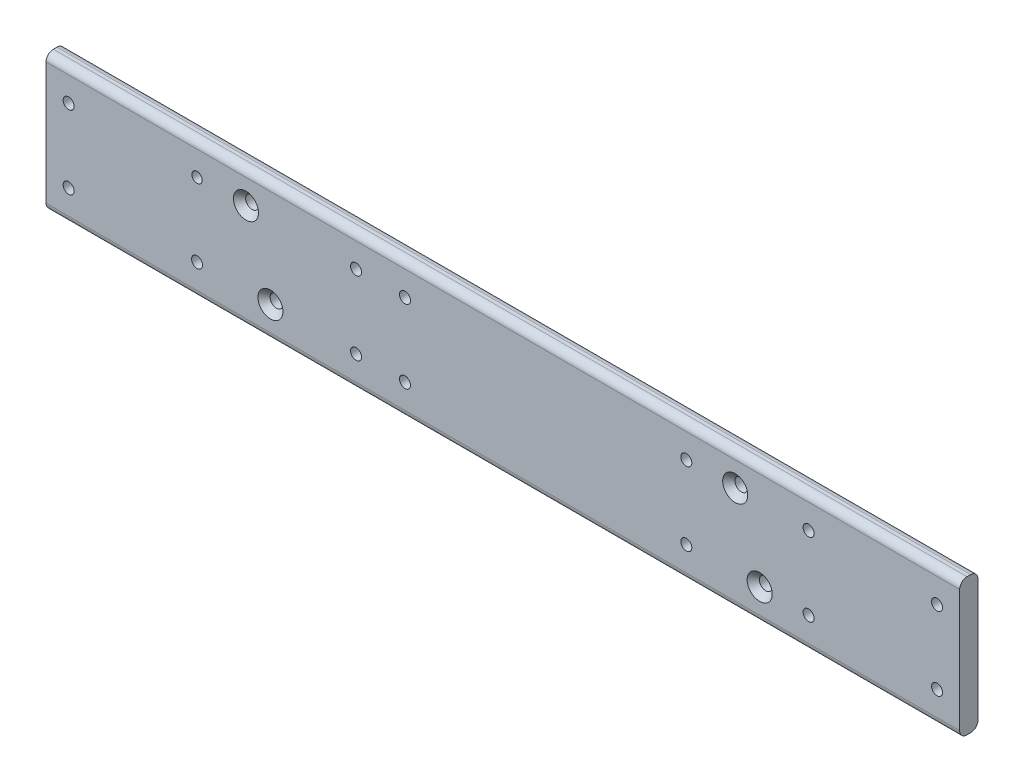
ISO-10303-21;
HEADER;
FILE_DESCRIPTION(('STEP AP214'),'2;1');
FILE_NAME('part.step','',(''),(''),'','','');
FILE_SCHEMA(('AUTOMOTIVE_DESIGN { 1 0 10303 214 1 1 1 1 }'));
ENDSEC;
DATA;
#1=APPLICATION_CONTEXT('core data for automotive mechanical design processes');
#2=APPLICATION_PROTOCOL_DEFINITION('international standard','automotive_design',2000,#1);
#3=PRODUCT_CONTEXT('',#1,'mechanical');
#4=PRODUCT('Part','Part','',(#3));
#5=PRODUCT_RELATED_PRODUCT_CATEGORY('part','',(#4));
#6=PRODUCT_DEFINITION_FORMATION('','',#4);
#7=PRODUCT_DEFINITION_CONTEXT('part definition',#1,'design');
#8=PRODUCT_DEFINITION('design','',#6,#7);
#9=PRODUCT_DEFINITION_SHAPE('','',#8);
#10=(LENGTH_UNIT() NAMED_UNIT(*) SI_UNIT(.MILLI.,.METRE.));
#11=(NAMED_UNIT(*) PLANE_ANGLE_UNIT() SI_UNIT($,.RADIAN.));
#12=(NAMED_UNIT(*) SI_UNIT($,.STERADIAN.) SOLID_ANGLE_UNIT());
#13=UNCERTAINTY_MEASURE_WITH_UNIT(LENGTH_MEASURE(1.E-05),#10,'distance_accuracy_value','');
#14=(GEOMETRIC_REPRESENTATION_CONTEXT(3) GLOBAL_UNCERTAINTY_ASSIGNED_CONTEXT((#13)) GLOBAL_UNIT_ASSIGNED_CONTEXT((#10,
#11,#12)) REPRESENTATION_CONTEXT('',''));
#15=CARTESIAN_POINT('',(0.,0.,0.));
#16=DIRECTION('',(0.,0.,1.));
#17=DIRECTION('',(1.,0.,0.));
#18=AXIS2_PLACEMENT_3D('',#15,#16,#17);
#19=CARTESIAN_POINT('',(752.,112.,15.));
#20=DIRECTION('',(0.,0.,1.));
#21=DIRECTION('',(1.,0.,0.));
#22=AXIS2_PLACEMENT_3D('',#19,#20,#21);
#23=PLANE('',#22);
#24=CARTESIAN_POINT('',(1335.5,25.9999999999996,15.));
#25=DIRECTION('',(0.,0.,1.));
#26=DIRECTION('',(1.,0.,0.));
#27=AXIS2_PLACEMENT_3D('',#24,#25,#26);
#28=CIRCLE('',#27,10.2500000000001);
#29=CARTESIAN_POINT('',(1345.75,25.9999999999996,15.));
#30=VERTEX_POINT('',#29);
#31=EDGE_CURVE('E162',#30,#30,#28,.F.);
#32=ORIENTED_EDGE('',*,*,#31,.T.);
#33=EDGE_LOOP('',(#32));
#34=FACE_BOUND('',#33,.T.);
#35=CARTESIAN_POINT('',(1315.5,85.9999999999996,15.));
#36=DIRECTION('',(0.,0.,1.));
#37=DIRECTION('',(1.,0.,0.));
#38=AXIS2_PLACEMENT_3D('',#35,#36,#37);
#39=CIRCLE('',#38,10.2500000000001);
#40=CARTESIAN_POINT('',(1325.75,85.9999999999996,15.));
#41=VERTEX_POINT('',#40);
#42=EDGE_CURVE('E159',#41,#41,#39,.F.);
#43=ORIENTED_EDGE('',*,*,#42,.T.);
#44=EDGE_LOOP('',(#43));
#45=FACE_BOUND('',#44,.T.);
#46=CARTESIAN_POINT('',(935.5,25.9999999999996,15.));
#47=DIRECTION('',(0.,0.,1.));
#48=DIRECTION('',(1.,0.,0.));
#49=AXIS2_PLACEMENT_3D('',#46,#47,#48);
#50=CIRCLE('',#49,10.25);
#51=CARTESIAN_POINT('',(945.75,25.9999999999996,15.));
#52=VERTEX_POINT('',#51);
#53=EDGE_CURVE('E156',#52,#52,#50,.F.);
#54=ORIENTED_EDGE('',*,*,#53,.T.);
#55=EDGE_LOOP('',(#54));
#56=FACE_BOUND('',#55,.T.);
#57=CARTESIAN_POINT('',(915.5,85.9999999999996,15.));
#58=DIRECTION('',(0.,0.,1.));
#59=DIRECTION('',(1.,0.,0.));
#60=AXIS2_PLACEMENT_3D('',#57,#58,#59);
#61=CIRCLE('',#60,10.25);
#62=CARTESIAN_POINT('',(925.75,85.9999999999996,15.));
#63=VERTEX_POINT('',#62);
#64=EDGE_CURVE('E153',#63,#63,#61,.F.);
#65=ORIENTED_EDGE('',*,*,#64,.T.);
#66=EDGE_LOOP('',(#65));
#67=FACE_BOUND('',#66,.T.);
#68=CARTESIAN_POINT('',(875.5,25.9999999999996,15.));
#69=DIRECTION('',(0.,0.,1.));
#70=DIRECTION('',(1.,0.,0.));
#71=AXIS2_PLACEMENT_3D('',#68,#69,#70);
#72=CIRCLE('',#71,4.49999999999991);
#73=CARTESIAN_POINT('',(880.,25.9999999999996,15.));
#74=VERTEX_POINT('',#73);
#75=EDGE_CURVE('E412',#74,#74,#72,.T.);
#76=ORIENTED_EDGE('',*,*,#75,.F.);
#77=EDGE_LOOP('',(#76));
#78=FACE_BOUND('',#77,.T.);
#79=CARTESIAN_POINT('',(1375.5,25.9999999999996,15.));
#80=DIRECTION('',(0.,0.,1.));
#81=DIRECTION('',(1.,0.,0.));
#82=AXIS2_PLACEMENT_3D('',#79,#80,#81);
#83=CIRCLE('',#82,4.50000000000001);
#84=CARTESIAN_POINT('',(1380.,25.9999999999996,15.));
#85=VERTEX_POINT('',#84);
#86=EDGE_CURVE('E403',#85,#85,#83,.T.);
#87=ORIENTED_EDGE('',*,*,#86,.F.);
#88=EDGE_LOOP('',(#87));
#89=FACE_BOUND('',#88,.T.);
#90=CARTESIAN_POINT('',(1275.5,25.9999999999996,15.));
#91=DIRECTION('',(0.,0.,1.));
#92=DIRECTION('',(1.,0.,0.));
#93=AXIS2_PLACEMENT_3D('',#90,#91,#92);
#94=CIRCLE('',#93,4.50000000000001);
#95=CARTESIAN_POINT('',(1280.,25.9999999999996,15.));
#96=VERTEX_POINT('',#95);
#97=EDGE_CURVE('E391',#96,#96,#94,.T.);
#98=ORIENTED_EDGE('',*,*,#97,.F.);
#99=EDGE_LOOP('',(#98));
#100=FACE_BOUND('',#99,.T.);
#101=CARTESIAN_POINT('',(1480.5,25.9999999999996,15.));
#102=DIRECTION('',(0.,0.,1.));
#103=DIRECTION('',(1.,0.,0.));
#104=AXIS2_PLACEMENT_3D('',#101,#102,#103);
#105=CIRCLE('',#104,4.50000000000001);
#106=CARTESIAN_POINT('',(1485.,25.9999999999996,15.));
#107=VERTEX_POINT('',#106);
#108=EDGE_CURVE('E379',#107,#107,#105,.T.);
#109=ORIENTED_EDGE('',*,*,#108,.F.);
#110=EDGE_LOOP('',(#109));
#111=FACE_BOUND('',#110,.T.);
#112=CARTESIAN_POINT('',(770.5,25.9999999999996,15.));
#113=DIRECTION('',(0.,0.,1.));
#114=DIRECTION('',(1.,0.,0.));
#115=AXIS2_PLACEMENT_3D('',#112,#113,#114);
#116=CIRCLE('',#115,4.49999999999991);
#117=CARTESIAN_POINT('',(775.,25.9999999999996,15.));
#118=VERTEX_POINT('',#117);
#119=EDGE_CURVE('E367',#118,#118,#116,.T.);
#120=ORIENTED_EDGE('',*,*,#119,.F.);
#121=EDGE_LOOP('',(#120));
#122=FACE_BOUND('',#121,.T.);
#123=CARTESIAN_POINT('',(1005.5,25.9999999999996,15.));
#124=DIRECTION('',(0.,0.,1.));
#125=DIRECTION('',(1.,0.,0.));
#126=AXIS2_PLACEMENT_3D('',#123,#124,#125);
#127=CIRCLE('',#126,4.50000000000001);
#128=CARTESIAN_POINT('',(1010.,25.9999999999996,15.));
#129=VERTEX_POINT('',#128);
#130=EDGE_CURVE('E355',#129,#129,#127,.T.);
#131=ORIENTED_EDGE('',*,*,#130,.F.);
#132=EDGE_LOOP('',(#131));
#133=FACE_BOUND('',#132,.T.);
#134=CARTESIAN_POINT('',(1005.5,85.9999999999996,15.));
#135=DIRECTION('',(0.,0.,1.));
#136=DIRECTION('',(1.,0.,0.));
#137=AXIS2_PLACEMENT_3D('',#134,#135,#136);
#138=CIRCLE('',#137,4.50000000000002);
#139=CARTESIAN_POINT('',(1010.,85.9999999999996,15.));
#140=VERTEX_POINT('',#139);
#141=EDGE_CURVE('E343',#140,#140,#138,.T.);
#142=ORIENTED_EDGE('',*,*,#141,.F.);
#143=EDGE_LOOP('',(#142));
#144=FACE_BOUND('',#143,.T.);
#145=CARTESIAN_POINT('',(875.5,85.9999999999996,15.));
#146=DIRECTION('',(0.,0.,1.));
#147=DIRECTION('',(1.,0.,0.));
#148=AXIS2_PLACEMENT_3D('',#145,#146,#147);
#149=CIRCLE('',#148,4.25);
#150=CARTESIAN_POINT('',(879.75,85.9999999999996,15.));
#151=VERTEX_POINT('',#150);
#152=EDGE_CURVE('E118',#151,#151,#149,.T.);
#153=ORIENTED_EDGE('',*,*,#152,.F.);
#154=EDGE_LOOP('',(#153));
#155=FACE_BOUND('',#154,.T.);
#156=DIRECTION('',(0.,1.,0.));
#157=VECTOR('',#156,1.);
#158=CARTESIAN_POINT('',(1499.,-3.12250225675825E-13,15.));
#159=LINE('',#158,#157);
#160=CARTESIAN_POINT('',(1499.,5.99999999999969,15.));
#161=VERTEX_POINT('',#160);
#162=CARTESIAN_POINT('',(1499.,106.,15.));
#163=VERTEX_POINT('',#162);
#164=EDGE_CURVE('E225',#161,#163,#159,.T.);
#165=ORIENTED_EDGE('',*,*,#164,.T.);
#166=DIRECTION('',(1.,0.,0.));
#167=VECTOR('',#166,1.);
#168=CARTESIAN_POINT('',(752.,106.,15.));
#169=LINE('',#168,#167);
#170=CARTESIAN_POINT('',(752.,106.,15.));
#171=VERTEX_POINT('',#170);
#172=EDGE_CURVE('E52',#163,#171,#169,.F.);
#173=ORIENTED_EDGE('',*,*,#172,.T.);
#174=DIRECTION('',(0.,-1.,0.));
#175=VECTOR('',#174,1.);
#176=CARTESIAN_POINT('',(752.,112.,15.));
#177=LINE('',#176,#175);
#178=CARTESIAN_POINT('',(752.,5.9999999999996,15.));
#179=VERTEX_POINT('',#178);
#180=EDGE_CURVE('E223',#171,#179,#177,.T.);
#181=ORIENTED_EDGE('',*,*,#180,.T.);
#182=DIRECTION('',(-1.,0.,0.));
#183=VECTOR('',#182,1.);
#184=CARTESIAN_POINT('',(752.,5.99999999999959,15.));
#185=LINE('',#184,#183);
#186=EDGE_CURVE('E147',#179,#161,#185,.F.);
#187=ORIENTED_EDGE('',*,*,#186,.T.);
#188=EDGE_LOOP('',(#165,#173,#181,#187));
#189=FACE_BOUND('',#188,.T.);
#190=CARTESIAN_POINT('',(1045.5,85.9999999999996,15.));
#191=DIRECTION('',(0.,0.,1.));
#192=DIRECTION('',(1.,0.,0.));
#193=AXIS2_PLACEMENT_3D('',#190,#191,#192);
#194=CIRCLE('',#193,4.50000000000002);
#195=CARTESIAN_POINT('',(1050.,85.9999999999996,15.));
#196=VERTEX_POINT('',#195);
#197=EDGE_CURVE('E335',#196,#196,#194,.T.);
#198=ORIENTED_EDGE('',*,*,#197,.F.);
#199=EDGE_LOOP('',(#198));
#200=FACE_BOUND('',#199,.T.);
#201=CARTESIAN_POINT('',(1275.5,85.9999999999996,15.));
#202=DIRECTION('',(0.,0.,1.));
#203=DIRECTION('',(1.,0.,0.));
#204=AXIS2_PLACEMENT_3D('',#201,#202,#203);
#205=CIRCLE('',#204,4.50000000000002);
#206=CARTESIAN_POINT('',(1280.,85.9999999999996,15.));
#207=VERTEX_POINT('',#206);
#208=EDGE_CURVE('E349',#207,#207,#205,.T.);
#209=ORIENTED_EDGE('',*,*,#208,.F.);
#210=EDGE_LOOP('',(#209));
#211=FACE_BOUND('',#210,.T.);
#212=CARTESIAN_POINT('',(770.5,85.9999999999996,15.));
#213=DIRECTION('',(0.,0.,1.));
#214=DIRECTION('',(1.,0.,0.));
#215=AXIS2_PLACEMENT_3D('',#212,#213,#214);
#216=CIRCLE('',#215,4.49999999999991);
#217=CARTESIAN_POINT('',(775.,85.9999999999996,15.));
#218=VERTEX_POINT('',#217);
#219=EDGE_CURVE('E361',#218,#218,#216,.T.);
#220=ORIENTED_EDGE('',*,*,#219,.F.);
#221=EDGE_LOOP('',(#220));
#222=FACE_BOUND('',#221,.T.);
#223=CARTESIAN_POINT('',(1480.5,85.9999999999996,15.));
#224=DIRECTION('',(0.,0.,1.));
#225=DIRECTION('',(1.,0.,0.));
#226=AXIS2_PLACEMENT_3D('',#223,#224,#225);
#227=CIRCLE('',#226,4.50000000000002);
#228=CARTESIAN_POINT('',(1485.,85.9999999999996,15.));
#229=VERTEX_POINT('',#228);
#230=EDGE_CURVE('E373',#229,#229,#227,.T.);
#231=ORIENTED_EDGE('',*,*,#230,.F.);
#232=EDGE_LOOP('',(#231));
#233=FACE_BOUND('',#232,.T.);
#234=CARTESIAN_POINT('',(1045.5,25.9999999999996,15.));
#235=DIRECTION('',(0.,0.,1.));
#236=DIRECTION('',(1.,0.,0.));
#237=AXIS2_PLACEMENT_3D('',#234,#235,#236);
#238=CIRCLE('',#237,4.50000000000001);
#239=CARTESIAN_POINT('',(1050.,25.9999999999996,15.));
#240=VERTEX_POINT('',#239);
#241=EDGE_CURVE('E385',#240,#240,#238,.T.);
#242=ORIENTED_EDGE('',*,*,#241,.F.);
#243=EDGE_LOOP('',(#242));
#244=FACE_BOUND('',#243,.T.);
#245=CARTESIAN_POINT('',(1375.5,85.9999999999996,15.));
#246=DIRECTION('',(0.,0.,1.));
#247=DIRECTION('',(1.,0.,0.));
#248=AXIS2_PLACEMENT_3D('',#245,#246,#247);
#249=CIRCLE('',#248,4.50000000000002);
#250=CARTESIAN_POINT('',(1380.,85.9999999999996,15.));
#251=VERTEX_POINT('',#250);
#252=EDGE_CURVE('E397',#251,#251,#249,.T.);
#253=ORIENTED_EDGE('',*,*,#252,.F.);
#254=EDGE_LOOP('',(#253));
#255=FACE_BOUND('',#254,.T.);
#256=ADVANCED_FACE('F30',(#34,#45,#56,#67,#78,#89,#100,#111,#122,#133,#144,#155,#189,#200,#211,
#222,#233,#244,#255),#23,.T.);
#257=CARTESIAN_POINT('',(752.,112.,0.));
#258=DIRECTION('',(0.,0.,1.));
#259=DIRECTION('',(1.,0.,0.));
#260=AXIS2_PLACEMENT_3D('',#257,#258,#259);
#261=PLANE('',#260);
#262=CARTESIAN_POINT('',(1315.5,85.9999999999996,0.));
#263=DIRECTION('',(0.,0.,1.));
#264=DIRECTION('',(1.,0.,0.));
#265=AXIS2_PLACEMENT_3D('',#262,#263,#264);
#266=CIRCLE('',#265,5.25000000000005);
#267=CARTESIAN_POINT('',(1320.75,85.9999999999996,0.));
#268=VERTEX_POINT('',#267);
#269=EDGE_CURVE('E421',#268,#268,#266,.T.);
#270=ORIENTED_EDGE('',*,*,#269,.T.);
#271=EDGE_LOOP('',(#270));
#272=FACE_BOUND('',#271,.T.);
#273=CARTESIAN_POINT('',(875.5,25.9999999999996,0.));
#274=DIRECTION('',(0.,0.,1.));
#275=DIRECTION('',(1.,0.,0.));
#276=AXIS2_PLACEMENT_3D('',#273,#274,#275);
#277=CIRCLE('',#276,4.49999999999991);
#278=CARTESIAN_POINT('',(880.,25.9999999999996,0.));
#279=VERTEX_POINT('',#278);
#280=EDGE_CURVE('E415',#279,#279,#277,.T.);
#281=ORIENTED_EDGE('',*,*,#280,.T.);
#282=EDGE_LOOP('',(#281));
#283=FACE_BOUND('',#282,.T.);
#284=CARTESIAN_POINT('',(1375.5,25.9999999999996,0.));
#285=DIRECTION('',(0.,0.,1.));
#286=DIRECTION('',(1.,0.,0.));
#287=AXIS2_PLACEMENT_3D('',#284,#285,#286);
#288=CIRCLE('',#287,4.50000000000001);
#289=CARTESIAN_POINT('',(1380.,25.9999999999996,0.));
#290=VERTEX_POINT('',#289);
#291=EDGE_CURVE('E406',#290,#290,#288,.T.);
#292=ORIENTED_EDGE('',*,*,#291,.T.);
#293=EDGE_LOOP('',(#292));
#294=FACE_BOUND('',#293,.T.);
#295=CARTESIAN_POINT('',(1275.5,25.9999999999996,0.));
#296=DIRECTION('',(0.,0.,1.));
#297=DIRECTION('',(1.,0.,0.));
#298=AXIS2_PLACEMENT_3D('',#295,#296,#297);
#299=CIRCLE('',#298,4.50000000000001);
#300=CARTESIAN_POINT('',(1280.,25.9999999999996,0.));
#301=VERTEX_POINT('',#300);
#302=EDGE_CURVE('E394',#301,#301,#299,.T.);
#303=ORIENTED_EDGE('',*,*,#302,.T.);
#304=EDGE_LOOP('',(#303));
#305=FACE_BOUND('',#304,.T.);
#306=CARTESIAN_POINT('',(1480.5,25.9999999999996,0.));
#307=DIRECTION('',(0.,0.,1.));
#308=DIRECTION('',(1.,0.,0.));
#309=AXIS2_PLACEMENT_3D('',#306,#307,#308);
#310=CIRCLE('',#309,4.50000000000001);
#311=CARTESIAN_POINT('',(1485.,25.9999999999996,0.));
#312=VERTEX_POINT('',#311);
#313=EDGE_CURVE('E382',#312,#312,#310,.T.);
#314=ORIENTED_EDGE('',*,*,#313,.T.);
#315=EDGE_LOOP('',(#314));
#316=FACE_BOUND('',#315,.T.);
#317=CARTESIAN_POINT('',(770.5,25.9999999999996,0.));
#318=DIRECTION('',(0.,0.,1.));
#319=DIRECTION('',(1.,0.,0.));
#320=AXIS2_PLACEMENT_3D('',#317,#318,#319);
#321=CIRCLE('',#320,4.49999999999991);
#322=CARTESIAN_POINT('',(775.,25.9999999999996,0.));
#323=VERTEX_POINT('',#322);
#324=EDGE_CURVE('E370',#323,#323,#321,.T.);
#325=ORIENTED_EDGE('',*,*,#324,.T.);
#326=EDGE_LOOP('',(#325));
#327=FACE_BOUND('',#326,.T.);
#328=CARTESIAN_POINT('',(1005.5,25.9999999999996,0.));
#329=DIRECTION('',(0.,0.,1.));
#330=DIRECTION('',(1.,0.,0.));
#331=AXIS2_PLACEMENT_3D('',#328,#329,#330);
#332=CIRCLE('',#331,4.50000000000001);
#333=CARTESIAN_POINT('',(1010.,25.9999999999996,0.));
#334=VERTEX_POINT('',#333);
#335=EDGE_CURVE('E358',#334,#334,#332,.T.);
#336=ORIENTED_EDGE('',*,*,#335,.T.);
#337=EDGE_LOOP('',(#336));
#338=FACE_BOUND('',#337,.T.);
#339=CARTESIAN_POINT('',(1005.5,85.9999999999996,0.));
#340=DIRECTION('',(0.,0.,1.));
#341=DIRECTION('',(1.,0.,0.));
#342=AXIS2_PLACEMENT_3D('',#339,#340,#341);
#343=CIRCLE('',#342,4.50000000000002);
#344=CARTESIAN_POINT('',(1010.,85.9999999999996,0.));
#345=VERTEX_POINT('',#344);
#346=EDGE_CURVE('E346',#345,#345,#343,.T.);
#347=ORIENTED_EDGE('',*,*,#346,.T.);
#348=EDGE_LOOP('',(#347));
#349=FACE_BOUND('',#348,.T.);
#350=CARTESIAN_POINT('',(875.5,85.9999999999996,0.));
#351=DIRECTION('',(0.,0.,1.));
#352=DIRECTION('',(1.,0.,0.));
#353=AXIS2_PLACEMENT_3D('',#350,#351,#352);
#354=CIRCLE('',#353,4.25);
#355=CARTESIAN_POINT('',(879.75,85.9999999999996,0.));
#356=VERTEX_POINT('',#355);
#357=EDGE_CURVE('E333',#356,#356,#354,.T.);
#358=ORIENTED_EDGE('',*,*,#357,.T.);
#359=EDGE_LOOP('',(#358));
#360=FACE_BOUND('',#359,.T.);
#361=DIRECTION('',(0.,-1.,0.));
#362=VECTOR('',#361,1.);
#363=CARTESIAN_POINT('',(752.,112.,0.));
#364=LINE('',#363,#362);
#365=CARTESIAN_POINT('',(752.,106.,0.));
#366=VERTEX_POINT('',#365);
#367=CARTESIAN_POINT('',(752.,5.99999999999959,0.));
#368=VERTEX_POINT('',#367);
#369=EDGE_CURVE('E98',#366,#368,#364,.T.);
#370=ORIENTED_EDGE('',*,*,#369,.F.);
#371=DIRECTION('',(1.,0.,0.));
#372=VECTOR('',#371,1.);
#373=CARTESIAN_POINT('',(1499.,106.,0.));
#374=LINE('',#373,#372);
#375=CARTESIAN_POINT('',(1499.,106.,0.));
#376=VERTEX_POINT('',#375);
#377=EDGE_CURVE('E113',#366,#376,#374,.T.);
#378=ORIENTED_EDGE('',*,*,#377,.T.);
#379=DIRECTION('',(0.,1.,0.));
#380=VECTOR('',#379,1.);
#381=CARTESIAN_POINT('',(1499.,-3.12250225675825E-13,0.));
#382=LINE('',#381,#380);
#383=CARTESIAN_POINT('',(1499.,5.99999999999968,0.));
#384=VERTEX_POINT('',#383);
#385=EDGE_CURVE('E117',#384,#376,#382,.T.);
#386=ORIENTED_EDGE('',*,*,#385,.F.);
#387=DIRECTION('',(-1.,0.,0.));
#388=VECTOR('',#387,1.);
#389=CARTESIAN_POINT('',(752.,5.99999999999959,0.));
#390=LINE('',#389,#388);
#391=EDGE_CURVE('E116',#384,#368,#390,.T.);
#392=ORIENTED_EDGE('',*,*,#391,.T.);
#393=EDGE_LOOP('',(#370,#378,#386,#392));
#394=FACE_BOUND('',#393,.T.);
#395=CARTESIAN_POINT('',(1045.5,85.9999999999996,0.));
#396=DIRECTION('',(0.,0.,1.));
#397=DIRECTION('',(1.,0.,0.));
#398=AXIS2_PLACEMENT_3D('',#395,#396,#397);
#399=CIRCLE('',#398,4.50000000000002);
#400=CARTESIAN_POINT('',(1050.,85.9999999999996,0.));
#401=VERTEX_POINT('',#400);
#402=EDGE_CURVE('E338',#401,#401,#399,.T.);
#403=ORIENTED_EDGE('',*,*,#402,.T.);
#404=EDGE_LOOP('',(#403));
#405=FACE_BOUND('',#404,.T.);
#406=CARTESIAN_POINT('',(1275.5,85.9999999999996,0.));
#407=DIRECTION('',(0.,0.,1.));
#408=DIRECTION('',(1.,0.,0.));
#409=AXIS2_PLACEMENT_3D('',#406,#407,#408);
#410=CIRCLE('',#409,4.50000000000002);
#411=CARTESIAN_POINT('',(1280.,85.9999999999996,0.));
#412=VERTEX_POINT('',#411);
#413=EDGE_CURVE('E352',#412,#412,#410,.T.);
#414=ORIENTED_EDGE('',*,*,#413,.T.);
#415=EDGE_LOOP('',(#414));
#416=FACE_BOUND('',#415,.T.);
#417=CARTESIAN_POINT('',(770.5,85.9999999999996,0.));
#418=DIRECTION('',(0.,0.,1.));
#419=DIRECTION('',(1.,0.,0.));
#420=AXIS2_PLACEMENT_3D('',#417,#418,#419);
#421=CIRCLE('',#420,4.49999999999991);
#422=CARTESIAN_POINT('',(775.,85.9999999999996,0.));
#423=VERTEX_POINT('',#422);
#424=EDGE_CURVE('E364',#423,#423,#421,.T.);
#425=ORIENTED_EDGE('',*,*,#424,.T.);
#426=EDGE_LOOP('',(#425));
#427=FACE_BOUND('',#426,.T.);
#428=CARTESIAN_POINT('',(1480.5,85.9999999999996,0.));
#429=DIRECTION('',(0.,0.,1.));
#430=DIRECTION('',(1.,0.,0.));
#431=AXIS2_PLACEMENT_3D('',#428,#429,#430);
#432=CIRCLE('',#431,4.50000000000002);
#433=CARTESIAN_POINT('',(1485.,85.9999999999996,0.));
#434=VERTEX_POINT('',#433);
#435=EDGE_CURVE('E376',#434,#434,#432,.T.);
#436=ORIENTED_EDGE('',*,*,#435,.T.);
#437=EDGE_LOOP('',(#436));
#438=FACE_BOUND('',#437,.T.);
#439=CARTESIAN_POINT('',(1045.5,25.9999999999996,0.));
#440=DIRECTION('',(0.,0.,1.));
#441=DIRECTION('',(1.,0.,0.));
#442=AXIS2_PLACEMENT_3D('',#439,#440,#441);
#443=CIRCLE('',#442,4.50000000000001);
#444=CARTESIAN_POINT('',(1050.,25.9999999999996,0.));
#445=VERTEX_POINT('',#444);
#446=EDGE_CURVE('E388',#445,#445,#443,.T.);
#447=ORIENTED_EDGE('',*,*,#446,.T.);
#448=EDGE_LOOP('',(#447));
#449=FACE_BOUND('',#448,.T.);
#450=CARTESIAN_POINT('',(1375.5,85.9999999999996,0.));
#451=DIRECTION('',(0.,0.,1.));
#452=DIRECTION('',(1.,0.,0.));
#453=AXIS2_PLACEMENT_3D('',#450,#451,#452);
#454=CIRCLE('',#453,4.50000000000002);
#455=CARTESIAN_POINT('',(1380.,85.9999999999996,0.));
#456=VERTEX_POINT('',#455);
#457=EDGE_CURVE('E400',#456,#456,#454,.T.);
#458=ORIENTED_EDGE('',*,*,#457,.T.);
#459=EDGE_LOOP('',(#458));
#460=FACE_BOUND('',#459,.T.);
#461=CARTESIAN_POINT('',(915.5,85.9999999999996,0.));
#462=DIRECTION('',(0.,0.,1.));
#463=DIRECTION('',(1.,0.,0.));
#464=AXIS2_PLACEMENT_3D('',#461,#462,#463);
#465=CIRCLE('',#464,5.24999999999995);
#466=CARTESIAN_POINT('',(920.75,85.9999999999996,0.));
#467=VERTEX_POINT('',#466);
#468=EDGE_CURVE('E409',#467,#467,#465,.T.);
#469=ORIENTED_EDGE('',*,*,#468,.T.);
#470=EDGE_LOOP('',(#469));
#471=FACE_BOUND('',#470,.T.);
#472=CARTESIAN_POINT('',(935.5,25.9999999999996,0.));
#473=DIRECTION('',(0.,0.,1.));
#474=DIRECTION('',(1.,0.,0.));
#475=AXIS2_PLACEMENT_3D('',#472,#473,#474);
#476=CIRCLE('',#475,5.24999999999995);
#477=CARTESIAN_POINT('',(940.75,25.9999999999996,0.));
#478=VERTEX_POINT('',#477);
#479=EDGE_CURVE('E418',#478,#478,#476,.T.);
#480=ORIENTED_EDGE('',*,*,#479,.T.);
#481=EDGE_LOOP('',(#480));
#482=FACE_BOUND('',#481,.T.);
#483=CARTESIAN_POINT('',(1335.5,25.9999999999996,0.));
#484=DIRECTION('',(0.,0.,1.));
#485=DIRECTION('',(1.,0.,0.));
#486=AXIS2_PLACEMENT_3D('',#483,#484,#485);
#487=CIRCLE('',#486,5.25000000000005);
#488=CARTESIAN_POINT('',(1340.75,25.9999999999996,0.));
#489=VERTEX_POINT('',#488);
#490=EDGE_CURVE('E424',#489,#489,#487,.T.);
#491=ORIENTED_EDGE('',*,*,#490,.T.);
#492=EDGE_LOOP('',(#491));
#493=FACE_BOUND('',#492,.T.);
#494=ADVANCED_FACE('F110',(#272,#283,#294,#305,#316,#327,#338,#349,#360,#394,#405,#416,#427,
#438,#449,#460,#471,#482,#493),#261,.F.);
#495=CARTESIAN_POINT('',(752.,112.,15.));
#496=DIRECTION('',(1.,0.,0.));
#497=DIRECTION('',(0.,0.,-1.));
#498=AXIS2_PLACEMENT_3D('',#495,#496,#497);
#499=PLANE('',#498);
#500=DIRECTION('',(0.,0.,-1.));
#501=VECTOR('',#500,1.);
#502=CARTESIAN_POINT('',(752.,112.,15.));
#503=LINE('',#502,#501);
#504=CARTESIAN_POINT('',(752.,112.,9.));
#505=VERTEX_POINT('',#504);
#506=CARTESIAN_POINT('',(752.,112.,6.));
#507=VERTEX_POINT('',#506);
#508=EDGE_CURVE('E100',#505,#507,#503,.T.);
#509=ORIENTED_EDGE('',*,*,#508,.T.);
#510=CARTESIAN_POINT('',(752.,106.,6.));
#511=DIRECTION('',(1.,0.,0.));
#512=DIRECTION('',(0.,0.,-1.));
#513=AXIS2_PLACEMENT_3D('',#510,#511,#512);
#514=CIRCLE('',#513,6.);
#515=EDGE_CURVE('E96',#507,#366,#514,.F.);
#516=ORIENTED_EDGE('',*,*,#515,.T.);
#517=ORIENTED_EDGE('',*,*,#369,.T.);
#518=CARTESIAN_POINT('',(752.,5.99999999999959,6.));
#519=DIRECTION('',(1.,0.,0.));
#520=DIRECTION('',(0.,0.,-1.));
#521=AXIS2_PLACEMENT_3D('',#518,#519,#520);
#522=CIRCLE('',#521,6.);
#523=CARTESIAN_POINT('',(752.,-4.03728320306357E-13,6.));
#524=VERTEX_POINT('',#523);
#525=EDGE_CURVE('E105',#368,#524,#522,.F.);
#526=ORIENTED_EDGE('',*,*,#525,.T.);
#527=DIRECTION('',(0.,0.,-1.));
#528=VECTOR('',#527,1.);
#529=CARTESIAN_POINT('',(752.,-4.03728320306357E-13,15.));
#530=LINE('',#529,#528);
#531=CARTESIAN_POINT('',(752.,-4.03728320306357E-13,9.));
#532=VERTEX_POINT('',#531);
#533=EDGE_CURVE('E126',#532,#524,#530,.T.);
#534=ORIENTED_EDGE('',*,*,#533,.F.);
#535=CARTESIAN_POINT('',(752.,5.9999999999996,9.));
#536=DIRECTION('',(1.,0.,0.));
#537=DIRECTION('',(0.,0.,-1.));
#538=AXIS2_PLACEMENT_3D('',#535,#536,#537);
#539=CIRCLE('',#538,6.);
#540=EDGE_CURVE('E45',#532,#179,#539,.F.);
#541=ORIENTED_EDGE('',*,*,#540,.T.);
#542=ORIENTED_EDGE('',*,*,#180,.F.);
#543=CARTESIAN_POINT('',(752.,106.,9.));
#544=DIRECTION('',(1.,0.,0.));
#545=DIRECTION('',(0.,0.,-1.));
#546=AXIS2_PLACEMENT_3D('',#543,#544,#545);
#547=CIRCLE('',#546,6.);
#548=EDGE_CURVE('E140',#171,#505,#547,.F.);
#549=ORIENTED_EDGE('',*,*,#548,.T.);
#550=EDGE_LOOP('',(#509,#516,#517,#526,#534,#541,#542,#549));
#551=FACE_BOUND('',#550,.T.);
#552=ADVANCED_FACE('F32',(#551),#499,.F.);
#553=CARTESIAN_POINT('',(1499.,-3.12250225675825E-13,15.));
#554=DIRECTION('',(0.,-1.,0.));
#555=DIRECTION('',(1.,0.,0.));
#556=AXIS2_PLACEMENT_3D('',#553,#554,#555);
#557=PLANE('',#556);
#558=ORIENTED_EDGE('',*,*,#533,.T.);
#559=DIRECTION('',(-1.,0.,0.));
#560=VECTOR('',#559,1.);
#561=CARTESIAN_POINT('',(1499.,-3.12250225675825E-13,6.));
#562=LINE('',#561,#560);
#563=CARTESIAN_POINT('',(1499.,-3.12250225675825E-13,6.));
#564=VERTEX_POINT('',#563);
#565=EDGE_CURVE('E145',#524,#564,#562,.F.);
#566=ORIENTED_EDGE('',*,*,#565,.T.);
#567=DIRECTION('',(0.,0.,-1.));
#568=VECTOR('',#567,1.);
#569=CARTESIAN_POINT('',(1499.,-3.12250225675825E-13,15.));
#570=LINE('',#569,#568);
#571=CARTESIAN_POINT('',(1499.,-3.12250225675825E-13,9.));
#572=VERTEX_POINT('',#571);
#573=EDGE_CURVE('E219',#572,#564,#570,.T.);
#574=ORIENTED_EDGE('',*,*,#573,.F.);
#575=DIRECTION('',(-1.,0.,0.));
#576=VECTOR('',#575,1.);
#577=CARTESIAN_POINT('',(1499.,-3.12250225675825E-13,9.));
#578=LINE('',#577,#576);
#579=EDGE_CURVE('E104',#572,#532,#578,.T.);
#580=ORIENTED_EDGE('',*,*,#579,.T.);
#581=EDGE_LOOP('',(#558,#566,#574,#580));
#582=FACE_BOUND('',#581,.T.);
#583=ADVANCED_FACE('F207',(#582),#557,.T.);
#584=CARTESIAN_POINT('',(1499.,-3.12250225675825E-13,15.));
#585=DIRECTION('',(-1.,0.,0.));
#586=DIRECTION('',(0.,0.,1.));
#587=AXIS2_PLACEMENT_3D('',#584,#585,#586);
#588=PLANE('',#587);
#589=ORIENTED_EDGE('',*,*,#385,.T.);
#590=CARTESIAN_POINT('',(1499.,106.,6.));
#591=DIRECTION('',(-1.,0.,0.));
#592=DIRECTION('',(0.,0.,1.));
#593=AXIS2_PLACEMENT_3D('',#590,#591,#592);
#594=CIRCLE('',#593,6.);
#595=CARTESIAN_POINT('',(1499.,112.,6.));
#596=VERTEX_POINT('',#595);
#597=EDGE_CURVE('E121',#376,#596,#594,.F.);
#598=ORIENTED_EDGE('',*,*,#597,.T.);
#599=DIRECTION('',(0.,0.,-1.));
#600=VECTOR('',#599,1.);
#601=CARTESIAN_POINT('',(1499.,112.,15.));
#602=LINE('',#601,#600);
#603=CARTESIAN_POINT('',(1499.,112.,9.));
#604=VERTEX_POINT('',#603);
#605=EDGE_CURVE('E231',#604,#596,#602,.T.);
#606=ORIENTED_EDGE('',*,*,#605,.F.);
#607=CARTESIAN_POINT('',(1499.,106.,9.));
#608=DIRECTION('',(-1.,0.,0.));
#609=DIRECTION('',(0.,0.,1.));
#610=AXIS2_PLACEMENT_3D('',#607,#608,#609);
#611=CIRCLE('',#610,6.);
#612=EDGE_CURVE('E124',#604,#163,#611,.F.);
#613=ORIENTED_EDGE('',*,*,#612,.T.);
#614=ORIENTED_EDGE('',*,*,#164,.F.);
#615=CARTESIAN_POINT('',(1499.,5.99999999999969,9.));
#616=DIRECTION('',(-1.,0.,0.));
#617=DIRECTION('',(0.,0.,1.));
#618=AXIS2_PLACEMENT_3D('',#615,#616,#617);
#619=CIRCLE('',#618,6.);
#620=EDGE_CURVE('E122',#161,#572,#619,.F.);
#621=ORIENTED_EDGE('',*,*,#620,.T.);
#622=ORIENTED_EDGE('',*,*,#573,.T.);
#623=CARTESIAN_POINT('',(1499.,5.99999999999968,6.));
#624=DIRECTION('',(-1.,0.,0.));
#625=DIRECTION('',(0.,0.,1.));
#626=AXIS2_PLACEMENT_3D('',#623,#624,#625);
#627=CIRCLE('',#626,6.);
#628=EDGE_CURVE('E131',#564,#384,#627,.F.);
#629=ORIENTED_EDGE('',*,*,#628,.T.);
#630=EDGE_LOOP('',(#589,#598,#606,#613,#614,#621,#622,#629));
#631=FACE_BOUND('',#630,.T.);
#632=ADVANCED_FACE('F204',(#631),#588,.F.);
#633=CARTESIAN_POINT('',(752.,112.,15.));
#634=DIRECTION('',(0.,1.,0.));
#635=DIRECTION('',(0.,0.,1.));
#636=AXIS2_PLACEMENT_3D('',#633,#634,#635);
#637=PLANE('',#636);
#638=ORIENTED_EDGE('',*,*,#605,.T.);
#639=DIRECTION('',(1.,0.,0.));
#640=VECTOR('',#639,1.);
#641=CARTESIAN_POINT('',(752.,112.,6.));
#642=LINE('',#641,#640);
#643=EDGE_CURVE('E137',#596,#507,#642,.F.);
#644=ORIENTED_EDGE('',*,*,#643,.T.);
#645=ORIENTED_EDGE('',*,*,#508,.F.);
#646=DIRECTION('',(1.,0.,0.));
#647=VECTOR('',#646,1.);
#648=CARTESIAN_POINT('',(752.,112.,9.));
#649=LINE('',#648,#647);
#650=EDGE_CURVE('E134',#505,#604,#649,.T.);
#651=ORIENTED_EDGE('',*,*,#650,.T.);
#652=EDGE_LOOP('',(#638,#644,#645,#651));
#653=FACE_BOUND('',#652,.T.);
#654=ADVANCED_FACE('F200',(#653),#637,.T.);
#655=CARTESIAN_POINT('',(875.5,85.9999999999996,15.));
#656=DIRECTION('',(0.,0.,-1.));
#657=DIRECTION('',(-1.,0.,0.));
#658=AXIS2_PLACEMENT_3D('',#655,#656,#657);
#659=CYLINDRICAL_SURFACE('',#658,4.25);
#660=ORIENTED_EDGE('',*,*,#152,.T.);
#661=EDGE_LOOP('',(#660));
#662=FACE_BOUND('',#661,.T.);
#663=ORIENTED_EDGE('',*,*,#357,.F.);
#664=EDGE_LOOP('',(#663));
#665=FACE_BOUND('',#664,.T.);
#666=ADVANCED_FACE('F203',(#662,#665),#659,.F.);
#667=CARTESIAN_POINT('',(1045.5,85.9999999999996,15.));
#668=DIRECTION('',(0.,0.,-1.));
#669=DIRECTION('',(-1.,0.,0.));
#670=AXIS2_PLACEMENT_3D('',#667,#668,#669);
#671=CYLINDRICAL_SURFACE('',#670,4.50000000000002);
#672=ORIENTED_EDGE('',*,*,#197,.T.);
#673=EDGE_LOOP('',(#672));
#674=FACE_BOUND('',#673,.T.);
#675=ORIENTED_EDGE('',*,*,#402,.F.);
#676=EDGE_LOOP('',(#675));
#677=FACE_BOUND('',#676,.T.);
#678=ADVANCED_FACE('F320',(#674,#677),#671,.F.);
#679=CARTESIAN_POINT('',(1005.5,85.9999999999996,15.));
#680=DIRECTION('',(0.,0.,-1.));
#681=DIRECTION('',(-1.,0.,0.));
#682=AXIS2_PLACEMENT_3D('',#679,#680,#681);
#683=CYLINDRICAL_SURFACE('',#682,4.50000000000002);
#684=ORIENTED_EDGE('',*,*,#141,.T.);
#685=EDGE_LOOP('',(#684));
#686=FACE_BOUND('',#685,.T.);
#687=ORIENTED_EDGE('',*,*,#346,.F.);
#688=EDGE_LOOP('',(#687));
#689=FACE_BOUND('',#688,.T.);
#690=ADVANCED_FACE('F316',(#686,#689),#683,.F.);
#691=CARTESIAN_POINT('',(1275.5,85.9999999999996,15.));
#692=DIRECTION('',(0.,0.,-1.));
#693=DIRECTION('',(-1.,0.,0.));
#694=AXIS2_PLACEMENT_3D('',#691,#692,#693);
#695=CYLINDRICAL_SURFACE('',#694,4.50000000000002);
#696=ORIENTED_EDGE('',*,*,#208,.T.);
#697=EDGE_LOOP('',(#696));
#698=FACE_BOUND('',#697,.T.);
#699=ORIENTED_EDGE('',*,*,#413,.F.);
#700=EDGE_LOOP('',(#699));
#701=FACE_BOUND('',#700,.T.);
#702=ADVANCED_FACE('F312',(#698,#701),#695,.F.);
#703=CARTESIAN_POINT('',(1005.5,25.9999999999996,15.));
#704=DIRECTION('',(0.,0.,-1.));
#705=DIRECTION('',(-1.,0.,0.));
#706=AXIS2_PLACEMENT_3D('',#703,#704,#705);
#707=CYLINDRICAL_SURFACE('',#706,4.50000000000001);
#708=ORIENTED_EDGE('',*,*,#130,.T.);
#709=EDGE_LOOP('',(#708));
#710=FACE_BOUND('',#709,.T.);
#711=ORIENTED_EDGE('',*,*,#335,.F.);
#712=EDGE_LOOP('',(#711));
#713=FACE_BOUND('',#712,.T.);
#714=ADVANCED_FACE('F308',(#710,#713),#707,.F.);
#715=CARTESIAN_POINT('',(770.5,85.9999999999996,15.));
#716=DIRECTION('',(0.,0.,-1.));
#717=DIRECTION('',(-1.,0.,0.));
#718=AXIS2_PLACEMENT_3D('',#715,#716,#717);
#719=CYLINDRICAL_SURFACE('',#718,4.49999999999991);
#720=ORIENTED_EDGE('',*,*,#219,.T.);
#721=EDGE_LOOP('',(#720));
#722=FACE_BOUND('',#721,.T.);
#723=ORIENTED_EDGE('',*,*,#424,.F.);
#724=EDGE_LOOP('',(#723));
#725=FACE_BOUND('',#724,.T.);
#726=ADVANCED_FACE('F304',(#722,#725),#719,.F.);
#727=CARTESIAN_POINT('',(770.5,25.9999999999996,15.));
#728=DIRECTION('',(0.,0.,-1.));
#729=DIRECTION('',(-1.,0.,0.));
#730=AXIS2_PLACEMENT_3D('',#727,#728,#729);
#731=CYLINDRICAL_SURFACE('',#730,4.49999999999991);
#732=ORIENTED_EDGE('',*,*,#119,.T.);
#733=EDGE_LOOP('',(#732));
#734=FACE_BOUND('',#733,.T.);
#735=ORIENTED_EDGE('',*,*,#324,.F.);
#736=EDGE_LOOP('',(#735));
#737=FACE_BOUND('',#736,.T.);
#738=ADVANCED_FACE('F300',(#734,#737),#731,.F.);
#739=CARTESIAN_POINT('',(1480.5,85.9999999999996,15.));
#740=DIRECTION('',(0.,0.,-1.));
#741=DIRECTION('',(-1.,0.,0.));
#742=AXIS2_PLACEMENT_3D('',#739,#740,#741);
#743=CYLINDRICAL_SURFACE('',#742,4.50000000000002);
#744=ORIENTED_EDGE('',*,*,#230,.T.);
#745=EDGE_LOOP('',(#744));
#746=FACE_BOUND('',#745,.T.);
#747=ORIENTED_EDGE('',*,*,#435,.F.);
#748=EDGE_LOOP('',(#747));
#749=FACE_BOUND('',#748,.T.);
#750=ADVANCED_FACE('F296',(#746,#749),#743,.F.);
#751=CARTESIAN_POINT('',(1480.5,25.9999999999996,15.));
#752=DIRECTION('',(0.,0.,-1.));
#753=DIRECTION('',(-1.,0.,0.));
#754=AXIS2_PLACEMENT_3D('',#751,#752,#753);
#755=CYLINDRICAL_SURFACE('',#754,4.50000000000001);
#756=ORIENTED_EDGE('',*,*,#108,.T.);
#757=EDGE_LOOP('',(#756));
#758=FACE_BOUND('',#757,.T.);
#759=ORIENTED_EDGE('',*,*,#313,.F.);
#760=EDGE_LOOP('',(#759));
#761=FACE_BOUND('',#760,.T.);
#762=ADVANCED_FACE('F292',(#758,#761),#755,.F.);
#763=CARTESIAN_POINT('',(1045.5,25.9999999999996,15.));
#764=DIRECTION('',(0.,0.,-1.));
#765=DIRECTION('',(-1.,0.,0.));
#766=AXIS2_PLACEMENT_3D('',#763,#764,#765);
#767=CYLINDRICAL_SURFACE('',#766,4.50000000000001);
#768=ORIENTED_EDGE('',*,*,#241,.T.);
#769=EDGE_LOOP('',(#768));
#770=FACE_BOUND('',#769,.T.);
#771=ORIENTED_EDGE('',*,*,#446,.F.);
#772=EDGE_LOOP('',(#771));
#773=FACE_BOUND('',#772,.T.);
#774=ADVANCED_FACE('F288',(#770,#773),#767,.F.);
#775=CARTESIAN_POINT('',(1275.5,25.9999999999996,15.));
#776=DIRECTION('',(0.,0.,-1.));
#777=DIRECTION('',(-1.,0.,0.));
#778=AXIS2_PLACEMENT_3D('',#775,#776,#777);
#779=CYLINDRICAL_SURFACE('',#778,4.50000000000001);
#780=ORIENTED_EDGE('',*,*,#97,.T.);
#781=EDGE_LOOP('',(#780));
#782=FACE_BOUND('',#781,.T.);
#783=ORIENTED_EDGE('',*,*,#302,.F.);
#784=EDGE_LOOP('',(#783));
#785=FACE_BOUND('',#784,.T.);
#786=ADVANCED_FACE('F284',(#782,#785),#779,.F.);
#787=CARTESIAN_POINT('',(1375.5,85.9999999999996,15.));
#788=DIRECTION('',(0.,0.,-1.));
#789=DIRECTION('',(-1.,0.,0.));
#790=AXIS2_PLACEMENT_3D('',#787,#788,#789);
#791=CYLINDRICAL_SURFACE('',#790,4.50000000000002);
#792=ORIENTED_EDGE('',*,*,#252,.T.);
#793=EDGE_LOOP('',(#792));
#794=FACE_BOUND('',#793,.T.);
#795=ORIENTED_EDGE('',*,*,#457,.F.);
#796=EDGE_LOOP('',(#795));
#797=FACE_BOUND('',#796,.T.);
#798=ADVANCED_FACE('F280',(#794,#797),#791,.F.);
#799=CARTESIAN_POINT('',(1375.5,25.9999999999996,15.));
#800=DIRECTION('',(0.,0.,-1.));
#801=DIRECTION('',(-1.,0.,0.));
#802=AXIS2_PLACEMENT_3D('',#799,#800,#801);
#803=CYLINDRICAL_SURFACE('',#802,4.50000000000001);
#804=ORIENTED_EDGE('',*,*,#86,.T.);
#805=EDGE_LOOP('',(#804));
#806=FACE_BOUND('',#805,.T.);
#807=ORIENTED_EDGE('',*,*,#291,.F.);
#808=EDGE_LOOP('',(#807));
#809=FACE_BOUND('',#808,.T.);
#810=ADVANCED_FACE('F276',(#806,#809),#803,.F.);
#811=CARTESIAN_POINT('',(915.5,85.9999999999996,15.));
#812=DIRECTION('',(0.,0.,-1.));
#813=DIRECTION('',(-1.,0.,0.));
#814=AXIS2_PLACEMENT_3D('',#811,#812,#813);
#815=CYLINDRICAL_SURFACE('',#814,5.24999999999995);
#816=CARTESIAN_POINT('',(915.5,85.9999999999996,9.99999999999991));
#817=DIRECTION('',(0.,0.,1.));
#818=DIRECTION('',(1.,0.,0.));
#819=AXIS2_PLACEMENT_3D('',#816,#817,#818);
#820=CIRCLE('',#819,5.24999999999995);
#821=CARTESIAN_POINT('',(920.75,85.9999999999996,9.99999999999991));
#822=VERTEX_POINT('',#821);
#823=EDGE_CURVE('E11',#822,#822,#820,.T.);
#824=ORIENTED_EDGE('',*,*,#823,.T.);
#825=EDGE_LOOP('',(#824));
#826=FACE_BOUND('',#825,.T.);
#827=ORIENTED_EDGE('',*,*,#468,.F.);
#828=EDGE_LOOP('',(#827));
#829=FACE_BOUND('',#828,.T.);
#830=ADVANCED_FACE('F272',(#826,#829),#815,.F.);
#831=CARTESIAN_POINT('',(875.5,25.9999999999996,15.));
#832=DIRECTION('',(0.,0.,-1.));
#833=DIRECTION('',(-1.,0.,0.));
#834=AXIS2_PLACEMENT_3D('',#831,#832,#833);
#835=CYLINDRICAL_SURFACE('',#834,4.49999999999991);
#836=ORIENTED_EDGE('',*,*,#75,.T.);
#837=EDGE_LOOP('',(#836));
#838=FACE_BOUND('',#837,.T.);
#839=ORIENTED_EDGE('',*,*,#280,.F.);
#840=EDGE_LOOP('',(#839));
#841=FACE_BOUND('',#840,.T.);
#842=ADVANCED_FACE('F269',(#838,#841),#835,.F.);
#843=CARTESIAN_POINT('',(935.5,25.9999999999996,15.));
#844=DIRECTION('',(0.,0.,-1.));
#845=DIRECTION('',(-1.,0.,0.));
#846=AXIS2_PLACEMENT_3D('',#843,#844,#845);
#847=CYLINDRICAL_SURFACE('',#846,5.24999999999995);
#848=CARTESIAN_POINT('',(935.5,25.9999999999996,9.99999999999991));
#849=DIRECTION('',(0.,0.,1.));
#850=DIRECTION('',(1.,0.,0.));
#851=AXIS2_PLACEMENT_3D('',#848,#849,#850);
#852=CIRCLE('',#851,5.24999999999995);
#853=CARTESIAN_POINT('',(940.75,25.9999999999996,9.99999999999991));
#854=VERTEX_POINT('',#853);
#855=EDGE_CURVE('E38',#854,#854,#852,.T.);
#856=ORIENTED_EDGE('',*,*,#855,.T.);
#857=EDGE_LOOP('',(#856));
#858=FACE_BOUND('',#857,.T.);
#859=ORIENTED_EDGE('',*,*,#479,.F.);
#860=EDGE_LOOP('',(#859));
#861=FACE_BOUND('',#860,.T.);
#862=ADVANCED_FACE('F170',(#858,#861),#847,.F.);
#863=CARTESIAN_POINT('',(1315.5,85.9999999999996,15.));
#864=DIRECTION('',(0.,0.,-1.));
#865=DIRECTION('',(-1.,0.,0.));
#866=AXIS2_PLACEMENT_3D('',#863,#864,#865);
#867=CYLINDRICAL_SURFACE('',#866,5.25000000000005);
#868=CARTESIAN_POINT('',(1315.5,85.9999999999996,9.99999999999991));
#869=DIRECTION('',(0.,0.,1.));
#870=DIRECTION('',(1.,0.,0.));
#871=AXIS2_PLACEMENT_3D('',#868,#869,#870);
#872=CIRCLE('',#871,5.25000000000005);
#873=CARTESIAN_POINT('',(1320.75,85.9999999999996,9.99999999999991));
#874=VERTEX_POINT('',#873);
#875=EDGE_CURVE('E165',#874,#874,#872,.T.);
#876=ORIENTED_EDGE('',*,*,#875,.T.);
#877=EDGE_LOOP('',(#876));
#878=FACE_BOUND('',#877,.T.);
#879=ORIENTED_EDGE('',*,*,#269,.F.);
#880=EDGE_LOOP('',(#879));
#881=FACE_BOUND('',#880,.T.);
#882=ADVANCED_FACE('F262',(#878,#881),#867,.F.);
#883=CARTESIAN_POINT('',(1335.5,25.9999999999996,15.));
#884=DIRECTION('',(0.,0.,-1.));
#885=DIRECTION('',(-1.,0.,0.));
#886=AXIS2_PLACEMENT_3D('',#883,#884,#885);
#887=CYLINDRICAL_SURFACE('',#886,5.25000000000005);
#888=CARTESIAN_POINT('',(1335.5,25.9999999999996,9.99999999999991));
#889=DIRECTION('',(0.,0.,1.));
#890=DIRECTION('',(1.,0.,0.));
#891=AXIS2_PLACEMENT_3D('',#888,#889,#890);
#892=CIRCLE('',#891,5.25000000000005);
#893=CARTESIAN_POINT('',(1340.75,25.9999999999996,9.99999999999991));
#894=VERTEX_POINT('',#893);
#895=EDGE_CURVE('E150',#894,#894,#892,.T.);
#896=ORIENTED_EDGE('',*,*,#895,.T.);
#897=EDGE_LOOP('',(#896));
#898=FACE_BOUND('',#897,.T.);
#899=ORIENTED_EDGE('',*,*,#490,.F.);
#900=EDGE_LOOP('',(#899));
#901=FACE_BOUND('',#900,.T.);
#902=ADVANCED_FACE('F259',(#898,#901),#887,.F.);
#903=CARTESIAN_POINT('',(752.,106.,6.));
#904=DIRECTION('',(-1.,0.,0.));
#905=DIRECTION('',(0.,0.,1.));
#906=AXIS2_PLACEMENT_3D('',#903,#904,#905);
#907=CYLINDRICAL_SURFACE('',#906,6.);
#908=ORIENTED_EDGE('',*,*,#515,.F.);
#909=ORIENTED_EDGE('',*,*,#643,.F.);
#910=ORIENTED_EDGE('',*,*,#597,.F.);
#911=ORIENTED_EDGE('',*,*,#377,.F.);
#912=EDGE_LOOP('',(#908,#909,#910,#911));
#913=FACE_BOUND('',#912,.T.);
#914=ADVANCED_FACE('F120',(#913),#907,.T.);
#915=CARTESIAN_POINT('',(752.,5.99999999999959,6.));
#916=DIRECTION('',(1.,0.,0.));
#917=DIRECTION('',(0.,1.,0.));
#918=AXIS2_PLACEMENT_3D('',#915,#916,#917);
#919=CYLINDRICAL_SURFACE('',#918,6.);
#920=ORIENTED_EDGE('',*,*,#628,.F.);
#921=ORIENTED_EDGE('',*,*,#565,.F.);
#922=ORIENTED_EDGE('',*,*,#525,.F.);
#923=ORIENTED_EDGE('',*,*,#391,.F.);
#924=EDGE_LOOP('',(#920,#921,#922,#923));
#925=FACE_BOUND('',#924,.T.);
#926=ADVANCED_FACE('F222',(#925),#919,.T.);
#927=CARTESIAN_POINT('',(752.,106.,9.));
#928=DIRECTION('',(1.,0.,0.));
#929=DIRECTION('',(0.,0.,-1.));
#930=AXIS2_PLACEMENT_3D('',#927,#928,#929);
#931=CYLINDRICAL_SURFACE('',#930,6.);
#932=ORIENTED_EDGE('',*,*,#548,.F.);
#933=ORIENTED_EDGE('',*,*,#172,.F.);
#934=ORIENTED_EDGE('',*,*,#612,.F.);
#935=ORIENTED_EDGE('',*,*,#650,.F.);
#936=EDGE_LOOP('',(#932,#933,#934,#935));
#937=FACE_BOUND('',#936,.T.);
#938=ADVANCED_FACE('F242',(#937),#931,.T.);
#939=CARTESIAN_POINT('',(1499.,5.99999999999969,9.));
#940=DIRECTION('',(-1.,0.,0.));
#941=DIRECTION('',(0.,-1.,0.));
#942=AXIS2_PLACEMENT_3D('',#939,#940,#941);
#943=CYLINDRICAL_SURFACE('',#942,6.);
#944=ORIENTED_EDGE('',*,*,#620,.F.);
#945=ORIENTED_EDGE('',*,*,#186,.F.);
#946=ORIENTED_EDGE('',*,*,#540,.F.);
#947=ORIENTED_EDGE('',*,*,#579,.F.);
#948=EDGE_LOOP('',(#944,#945,#946,#947));
#949=FACE_BOUND('',#948,.T.);
#950=ADVANCED_FACE('F244',(#949),#943,.T.);
#951=CARTESIAN_POINT('',(1335.5,25.9999999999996,9.99999999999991));
#952=DIRECTION('',(0.,0.,1.));
#953=DIRECTION('',(1.,0.,0.));
#954=AXIS2_PLACEMENT_3D('',#951,#952,#953);
#955=CONICAL_SURFACE('',#954,5.25000000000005,0.785398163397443);
#956=ORIENTED_EDGE('',*,*,#31,.F.);
#957=EDGE_LOOP('',(#956));
#958=FACE_BOUND('',#957,.T.);
#959=ORIENTED_EDGE('',*,*,#895,.F.);
#960=EDGE_LOOP('',(#959));
#961=FACE_BOUND('',#960,.T.);
#962=ADVANCED_FACE('F185',(#958,#961),#955,.F.);
#963=CARTESIAN_POINT('',(1315.5,85.9999999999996,9.99999999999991));
#964=DIRECTION('',(0.,0.,1.));
#965=DIRECTION('',(1.,0.,0.));
#966=AXIS2_PLACEMENT_3D('',#963,#964,#965);
#967=CONICAL_SURFACE('',#966,5.25000000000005,0.785398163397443);
#968=ORIENTED_EDGE('',*,*,#42,.F.);
#969=EDGE_LOOP('',(#968));
#970=FACE_BOUND('',#969,.T.);
#971=ORIENTED_EDGE('',*,*,#875,.F.);
#972=EDGE_LOOP('',(#971));
#973=FACE_BOUND('',#972,.T.);
#974=ADVANCED_FACE('F176',(#970,#973),#967,.F.);
#975=CARTESIAN_POINT('',(935.5,25.9999999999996,9.99999999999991));
#976=DIRECTION('',(0.,0.,1.));
#977=DIRECTION('',(1.,0.,0.));
#978=AXIS2_PLACEMENT_3D('',#975,#976,#977);
#979=CONICAL_SURFACE('',#978,5.24999999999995,0.785398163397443);
#980=ORIENTED_EDGE('',*,*,#53,.F.);
#981=EDGE_LOOP('',(#980));
#982=FACE_BOUND('',#981,.T.);
#983=ORIENTED_EDGE('',*,*,#855,.F.);
#984=EDGE_LOOP('',(#983));
#985=FACE_BOUND('',#984,.T.);
#986=ADVANCED_FACE('F173',(#982,#985),#979,.F.);
#987=CARTESIAN_POINT('',(915.5,85.9999999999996,9.99999999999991));
#988=DIRECTION('',(0.,0.,1.));
#989=DIRECTION('',(1.,0.,0.));
#990=AXIS2_PLACEMENT_3D('',#987,#988,#989);
#991=CONICAL_SURFACE('',#990,5.24999999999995,0.785398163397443);
#992=ORIENTED_EDGE('',*,*,#64,.F.);
#993=EDGE_LOOP('',(#992));
#994=FACE_BOUND('',#993,.T.);
#995=ORIENTED_EDGE('',*,*,#823,.F.);
#996=EDGE_LOOP('',(#995));
#997=FACE_BOUND('',#996,.T.);
#998=ADVANCED_FACE('F175',(#994,#997),#991,.F.);
#999=CLOSED_SHELL('',(#256,#494,#552,#583,#632,#654,#666,#678,#690,#702,#714,#726,#738,#750,
#762,#774,#786,#798,#810,#830,#842,#862,#882,#902,#914,#926,#938,#950,#962,#974,#986,#998));
#1000=MANIFOLD_SOLID_BREP('B2',#999);
#1001=ADVANCED_BREP_SHAPE_REPRESENTATION('',(#18,#1000),#14);
#1002=SHAPE_DEFINITION_REPRESENTATION(#9,#1001);
ENDSEC;
END-ISO-10303-21;
